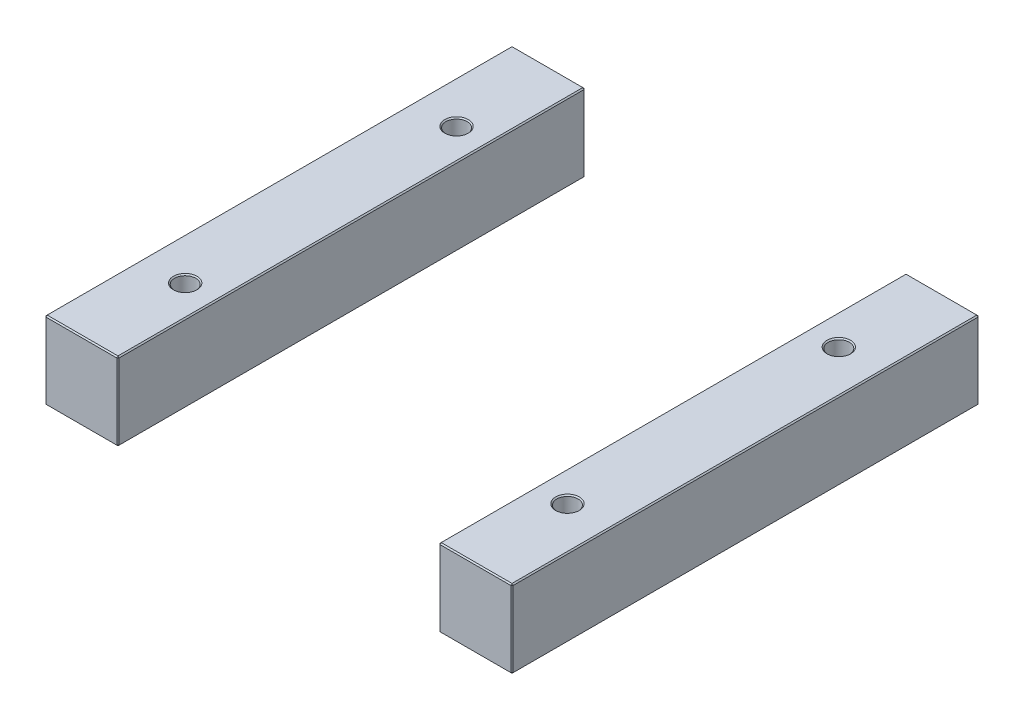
ISO-10303-21;
HEADER;
FILE_DESCRIPTION(('STEP AP214'),'2;1');
FILE_NAME('part.step','',(''),(''),'','','');
FILE_SCHEMA(('AUTOMOTIVE_DESIGN { 1 0 10303 214 1 1 1 1 }'));
ENDSEC;
DATA;
#1=APPLICATION_CONTEXT('core data for automotive mechanical design processes');
#2=APPLICATION_PROTOCOL_DEFINITION('international standard','automotive_design',2000,#1);
#3=PRODUCT_CONTEXT('',#1,'mechanical');
#4=PRODUCT('Part','Part','',(#3));
#5=PRODUCT_RELATED_PRODUCT_CATEGORY('part','',(#4));
#6=PRODUCT_DEFINITION_FORMATION('','',#4);
#7=PRODUCT_DEFINITION_CONTEXT('part definition',#1,'design');
#8=PRODUCT_DEFINITION('design','',#6,#7);
#9=PRODUCT_DEFINITION_SHAPE('','',#8);
#10=(LENGTH_UNIT() NAMED_UNIT(*) SI_UNIT(.MILLI.,.METRE.));
#11=(NAMED_UNIT(*) PLANE_ANGLE_UNIT() SI_UNIT($,.RADIAN.));
#12=(NAMED_UNIT(*) SI_UNIT($,.STERADIAN.) SOLID_ANGLE_UNIT());
#13=UNCERTAINTY_MEASURE_WITH_UNIT(LENGTH_MEASURE(1.E-05),#10,'distance_accuracy_value','');
#14=(GEOMETRIC_REPRESENTATION_CONTEXT(3) GLOBAL_UNCERTAINTY_ASSIGNED_CONTEXT((#13)) GLOBAL_UNIT_ASSIGNED_CONTEXT((#10,
#11,#12)) REPRESENTATION_CONTEXT('',''));
#15=CARTESIAN_POINT('',(0.,0.,0.));
#16=DIRECTION('',(0.,0.,1.));
#17=DIRECTION('',(1.,0.,0.));
#18=AXIS2_PLACEMENT_3D('',#15,#16,#17);
#19=CARTESIAN_POINT('',(-198.,66.,-198.));
#20=DIRECTION('',(0.,0.,1.));
#21=DIRECTION('',(1.,0.,0.));
#22=AXIS2_PLACEMENT_3D('',#19,#20,#21);
#23=PLANE('',#22);
#24=DIRECTION('',(-1.,0.,0.));
#25=VECTOR('',#24,1.);
#26=CARTESIAN_POINT('',(-198.,1.00000000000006,-198.));
#27=LINE('',#26,#25);
#28=CARTESIAN_POINT('',(-137.,1.00000000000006,-198.));
#29=VERTEX_POINT('',#28);
#30=CARTESIAN_POINT('',(-197.,1.00000000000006,-198.));
#31=VERTEX_POINT('',#30);
#32=EDGE_CURVE('P0_E137',#29,#31,#27,.T.);
#33=ORIENTED_EDGE('',*,*,#32,.T.);
#34=DIRECTION('',(0.,1.,0.));
#35=VECTOR('',#34,1.);
#36=CARTESIAN_POINT('',(-197.,66.,-198.));
#37=LINE('',#36,#35);
#38=CARTESIAN_POINT('',(-197.,65.,-198.));
#39=VERTEX_POINT('',#38);
#40=EDGE_CURVE('P0_E235',#31,#39,#37,.T.);
#41=ORIENTED_EDGE('',*,*,#40,.T.);
#42=DIRECTION('',(1.,0.,0.));
#43=VECTOR('',#42,1.);
#44=CARTESIAN_POINT('',(-198.,65.,-198.));
#45=LINE('',#44,#43);
#46=CARTESIAN_POINT('',(-137.,65.,-198.));
#47=VERTEX_POINT('',#46);
#48=EDGE_CURVE('P0_E233',#39,#47,#45,.T.);
#49=ORIENTED_EDGE('',*,*,#48,.T.);
#50=DIRECTION('',(0.,-1.,0.));
#51=VECTOR('',#50,1.);
#52=CARTESIAN_POINT('',(-137.,66.,-198.));
#53=LINE('',#52,#51);
#54=EDGE_CURVE('P0_E230',#47,#29,#53,.T.);
#55=ORIENTED_EDGE('',*,*,#54,.T.);
#56=EDGE_LOOP('',(#33,#41,#49,#55));
#57=FACE_BOUND('',#56,.T.);
#58=ADVANCED_FACE('P0_F16',(#57),#23,.F.);
#59=CARTESIAN_POINT('',(-198.,66.,198.));
#60=DIRECTION('',(1.,0.,0.));
#61=DIRECTION('',(0.,0.,-1.));
#62=AXIS2_PLACEMENT_3D('',#59,#60,#61);
#63=PLANE('',#62);
#64=DIRECTION('',(0.,1.,0.));
#65=VECTOR('',#64,1.);
#66=CARTESIAN_POINT('',(-198.,66.,197.));
#67=LINE('',#66,#65);
#68=CARTESIAN_POINT('',(-198.,1.00000000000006,197.));
#69=VERTEX_POINT('',#68);
#70=CARTESIAN_POINT('',(-198.,65.,197.));
#71=VERTEX_POINT('',#70);
#72=EDGE_CURVE('P0_E217',#69,#71,#67,.T.);
#73=ORIENTED_EDGE('',*,*,#72,.T.);
#74=DIRECTION('',(0.,0.,-1.));
#75=VECTOR('',#74,1.);
#76=CARTESIAN_POINT('',(-198.,65.,198.));
#77=LINE('',#76,#75);
#78=CARTESIAN_POINT('',(-198.,65.,-197.));
#79=VERTEX_POINT('',#78);
#80=EDGE_CURVE('P0_E228',#71,#79,#77,.T.);
#81=ORIENTED_EDGE('',*,*,#80,.T.);
#82=DIRECTION('',(0.,-1.,0.));
#83=VECTOR('',#82,1.);
#84=CARTESIAN_POINT('',(-198.,66.,-197.));
#85=LINE('',#84,#83);
#86=CARTESIAN_POINT('',(-198.,1.00000000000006,-197.));
#87=VERTEX_POINT('',#86);
#88=EDGE_CURVE('P0_E225',#79,#87,#85,.T.);
#89=ORIENTED_EDGE('',*,*,#88,.T.);
#90=DIRECTION('',(0.,0.,1.));
#91=VECTOR('',#90,1.);
#92=CARTESIAN_POINT('',(-198.,1.00000000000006,198.));
#93=LINE('',#92,#91);
#94=EDGE_CURVE('P0_E214',#87,#69,#93,.T.);
#95=ORIENTED_EDGE('',*,*,#94,.T.);
#96=EDGE_LOOP('',(#73,#81,#89,#95));
#97=FACE_BOUND('',#96,.T.);
#98=ADVANCED_FACE('P0_F302',(#97),#63,.F.);
#99=CARTESIAN_POINT('',(-198.,66.,198.));
#100=DIRECTION('',(0.,0.,-1.));
#101=DIRECTION('',(-1.,0.,0.));
#102=AXIS2_PLACEMENT_3D('',#99,#100,#101);
#103=PLANE('',#102);
#104=DIRECTION('',(-1.,0.,0.));
#105=VECTOR('',#104,1.);
#106=CARTESIAN_POINT('',(-198.,65.,198.));
#107=LINE('',#106,#105);
#108=CARTESIAN_POINT('',(-137.,65.,198.));
#109=VERTEX_POINT('',#108);
#110=CARTESIAN_POINT('',(-197.,65.,198.));
#111=VERTEX_POINT('',#110);
#112=EDGE_CURVE('P0_E242',#109,#111,#107,.T.);
#113=ORIENTED_EDGE('',*,*,#112,.T.);
#114=DIRECTION('',(0.,-1.,0.));
#115=VECTOR('',#114,1.);
#116=CARTESIAN_POINT('',(-197.,66.,198.));
#117=LINE('',#116,#115);
#118=CARTESIAN_POINT('',(-197.,1.00000000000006,198.));
#119=VERTEX_POINT('',#118);
#120=EDGE_CURVE('P0_E244',#111,#119,#117,.T.);
#121=ORIENTED_EDGE('',*,*,#120,.T.);
#122=DIRECTION('',(1.,0.,0.));
#123=VECTOR('',#122,1.);
#124=CARTESIAN_POINT('',(-136.,1.00000000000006,198.));
#125=LINE('',#124,#123);
#126=CARTESIAN_POINT('',(-137.,1.00000000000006,198.));
#127=VERTEX_POINT('',#126);
#128=EDGE_CURVE('P0_E240',#119,#127,#125,.T.);
#129=ORIENTED_EDGE('',*,*,#128,.T.);
#130=DIRECTION('',(0.,1.,0.));
#131=VECTOR('',#130,1.);
#132=CARTESIAN_POINT('',(-137.,66.,198.));
#133=LINE('',#132,#131);
#134=EDGE_CURVE('P0_E238',#127,#109,#133,.T.);
#135=ORIENTED_EDGE('',*,*,#134,.T.);
#136=EDGE_LOOP('',(#113,#121,#129,#135));
#137=FACE_BOUND('',#136,.T.);
#138=ADVANCED_FACE('P0_F341',(#137),#103,.F.);
#139=CARTESIAN_POINT('',(-136.,66.,-198.));
#140=DIRECTION('',(-1.,0.,0.));
#141=DIRECTION('',(0.,0.,1.));
#142=AXIS2_PLACEMENT_3D('',#139,#140,#141);
#143=PLANE('',#142);
#144=DIRECTION('',(0.,0.,1.));
#145=VECTOR('',#144,1.);
#146=CARTESIAN_POINT('',(-136.,65.,-198.));
#147=LINE('',#146,#145);
#148=CARTESIAN_POINT('',(-136.,65.,-197.));
#149=VERTEX_POINT('',#148);
#150=CARTESIAN_POINT('',(-136.,65.,197.));
#151=VERTEX_POINT('',#150);
#152=EDGE_CURVE('P0_E31',#149,#151,#147,.T.);
#153=ORIENTED_EDGE('',*,*,#152,.T.);
#154=DIRECTION('',(0.,-1.,0.));
#155=VECTOR('',#154,1.);
#156=CARTESIAN_POINT('',(-136.,66.,197.));
#157=LINE('',#156,#155);
#158=CARTESIAN_POINT('',(-136.,1.00000000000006,197.));
#159=VERTEX_POINT('',#158);
#160=EDGE_CURVE('P0_E190',#151,#159,#157,.T.);
#161=ORIENTED_EDGE('',*,*,#160,.T.);
#162=DIRECTION('',(0.,0.,-1.));
#163=VECTOR('',#162,1.);
#164=CARTESIAN_POINT('',(-136.,1.00000000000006,-198.));
#165=LINE('',#164,#163);
#166=CARTESIAN_POINT('',(-136.,1.00000000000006,-197.));
#167=VERTEX_POINT('',#166);
#168=EDGE_CURVE('P0_E256',#159,#167,#165,.T.);
#169=ORIENTED_EDGE('',*,*,#168,.T.);
#170=DIRECTION('',(0.,1.,0.));
#171=VECTOR('',#170,1.);
#172=CARTESIAN_POINT('',(-136.,66.,-197.));
#173=LINE('',#172,#171);
#174=EDGE_CURVE('P0_E36',#167,#149,#173,.T.);
#175=ORIENTED_EDGE('',*,*,#174,.T.);
#176=EDGE_LOOP('',(#153,#161,#169,#175));
#177=FACE_BOUND('',#176,.T.);
#178=ADVANCED_FACE('P0_F535',(#177),#143,.F.);
#179=CARTESIAN_POINT('',(0.,66.,0.));
#180=DIRECTION('',(0.,-1.,0.));
#181=DIRECTION('',(0.,0.,-1.));
#182=AXIS2_PLACEMENT_3D('',#179,#180,#181);
#183=PLANE('',#182);
#184=CARTESIAN_POINT('',(-162.,66.,115.));
#185=DIRECTION('',(0.,-1.,0.));
#186=DIRECTION('',(0.,0.,-1.));
#187=AXIS2_PLACEMENT_3D('',#184,#185,#186);
#188=CIRCLE('',#187,10.);
#189=CARTESIAN_POINT('',(-162.,66.,105.));
#190=VERTEX_POINT('',#189);
#191=EDGE_CURVE('P0_E24',#190,#190,#188,.T.);
#192=ORIENTED_EDGE('',*,*,#191,.T.);
#193=EDGE_LOOP('',(#192));
#194=FACE_BOUND('',#193,.T.);
#195=CARTESIAN_POINT('',(-162.,66.,-115.));
#196=DIRECTION('',(0.,-1.,0.));
#197=DIRECTION('',(0.,0.,-1.));
#198=AXIS2_PLACEMENT_3D('',#195,#196,#197);
#199=CIRCLE('',#198,10.);
#200=CARTESIAN_POINT('',(-162.,66.,-125.));
#201=VERTEX_POINT('',#200);
#202=EDGE_CURVE('P0_E189',#201,#201,#199,.T.);
#203=ORIENTED_EDGE('',*,*,#202,.T.);
#204=EDGE_LOOP('',(#203));
#205=FACE_BOUND('',#204,.T.);
#206=DIRECTION('',(0.,0.,1.));
#207=VECTOR('',#206,1.);
#208=CARTESIAN_POINT('',(-197.,66.,1.38076979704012E-13));
#209=LINE('',#208,#207);
#210=CARTESIAN_POINT('',(-197.,66.,-197.));
#211=VERTEX_POINT('',#210);
#212=CARTESIAN_POINT('',(-197.,66.,197.));
#213=VERTEX_POINT('',#212);
#214=EDGE_CURVE('P0_E251',#211,#213,#209,.T.);
#215=ORIENTED_EDGE('',*,*,#214,.T.);
#216=DIRECTION('',(1.,0.,0.));
#217=VECTOR('',#216,1.);
#218=CARTESIAN_POINT('',(-1.76382206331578E-13,66.,197.));
#219=LINE('',#218,#217);
#220=CARTESIAN_POINT('',(-137.,66.,197.));
#221=VERTEX_POINT('',#220);
#222=EDGE_CURVE('P0_E253',#213,#221,#219,.T.);
#223=ORIENTED_EDGE('',*,*,#222,.T.);
#224=DIRECTION('',(0.,0.,-1.));
#225=VECTOR('',#224,1.);
#226=CARTESIAN_POINT('',(-137.,66.,0.));
#227=LINE('',#226,#225);
#228=CARTESIAN_POINT('',(-137.,66.,-197.));
#229=VERTEX_POINT('',#228);
#230=EDGE_CURVE('P0_E247',#221,#229,#227,.T.);
#231=ORIENTED_EDGE('',*,*,#230,.T.);
#232=DIRECTION('',(-1.,0.,0.));
#233=VECTOR('',#232,1.);
#234=CARTESIAN_POINT('',(2.64573309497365E-13,66.,-197.));
#235=LINE('',#234,#233);
#236=EDGE_CURVE('P0_E249',#229,#211,#235,.T.);
#237=ORIENTED_EDGE('',*,*,#236,.T.);
#238=EDGE_LOOP('',(#215,#223,#231,#237));
#239=FACE_BOUND('',#238,.T.);
#240=ADVANCED_FACE('P0_F195',(#194,#205,#239),#183,.F.);
#241=CARTESIAN_POINT('',(0.,0.,0.));
#242=DIRECTION('',(0.,-1.,0.));
#243=DIRECTION('',(0.,0.,-1.));
#244=AXIS2_PLACEMENT_3D('',#241,#242,#243);
#245=PLANE('',#244);
#246=CARTESIAN_POINT('',(-162.,0.,-115.));
#247=DIRECTION('',(0.,-1.,0.));
#248=DIRECTION('',(0.,0.,-1.));
#249=AXIS2_PLACEMENT_3D('',#246,#247,#248);
#250=CIRCLE('',#249,10.);
#251=CARTESIAN_POINT('',(-162.,0.,-125.));
#252=VERTEX_POINT('',#251);
#253=EDGE_CURVE('P0_E220',#252,#252,#250,.F.);
#254=ORIENTED_EDGE('',*,*,#253,.T.);
#255=EDGE_LOOP('',(#254));
#256=FACE_BOUND('',#255,.T.);
#257=CARTESIAN_POINT('',(-162.,0.,115.));
#258=DIRECTION('',(0.,-1.,0.));
#259=DIRECTION('',(0.,0.,-1.));
#260=AXIS2_PLACEMENT_3D('',#257,#258,#259);
#261=CIRCLE('',#260,10.);
#262=CARTESIAN_POINT('',(-162.,0.,105.));
#263=VERTEX_POINT('',#262);
#264=EDGE_CURVE('P0_E608',#263,#263,#261,.F.);
#265=ORIENTED_EDGE('',*,*,#264,.T.);
#266=EDGE_LOOP('',(#265));
#267=FACE_BOUND('',#266,.T.);
#268=DIRECTION('',(-1.,0.,0.));
#269=VECTOR('',#268,1.);
#270=CARTESIAN_POINT('',(-198.,0.,197.));
#271=LINE('',#270,#269);
#272=CARTESIAN_POINT('',(-137.,0.,197.));
#273=VERTEX_POINT('',#272);
#274=CARTESIAN_POINT('',(-197.,0.,197.));
#275=VERTEX_POINT('',#274);
#276=EDGE_CURVE('P0_E114',#273,#275,#271,.T.);
#277=ORIENTED_EDGE('',*,*,#276,.T.);
#278=DIRECTION('',(0.,0.,-1.));
#279=VECTOR('',#278,1.);
#280=CARTESIAN_POINT('',(-197.,0.,-198.));
#281=LINE('',#280,#279);
#282=CARTESIAN_POINT('',(-197.,0.,-197.));
#283=VERTEX_POINT('',#282);
#284=EDGE_CURVE('P0_E110',#275,#283,#281,.T.);
#285=ORIENTED_EDGE('',*,*,#284,.T.);
#286=DIRECTION('',(1.,0.,0.));
#287=VECTOR('',#286,1.);
#288=CARTESIAN_POINT('',(-136.,0.,-197.));
#289=LINE('',#288,#287);
#290=CARTESIAN_POINT('',(-137.,0.,-197.));
#291=VERTEX_POINT('',#290);
#292=EDGE_CURVE('P0_E104',#283,#291,#289,.T.);
#293=ORIENTED_EDGE('',*,*,#292,.T.);
#294=DIRECTION('',(0.,0.,1.));
#295=VECTOR('',#294,1.);
#296=CARTESIAN_POINT('',(-137.,0.,198.));
#297=LINE('',#296,#295);
#298=EDGE_CURVE('P0_E107',#291,#273,#297,.T.);
#299=ORIENTED_EDGE('',*,*,#298,.T.);
#300=EDGE_LOOP('',(#277,#285,#293,#299));
#301=FACE_BOUND('',#300,.T.);
#302=ADVANCED_FACE('P0_F106',(#256,#267,#301),#245,.T.);
#303=CARTESIAN_POINT('',(-162.,0.,-115.));
#304=DIRECTION('',(0.,1.,0.));
#305=DIRECTION('',(0.,0.,1.));
#306=AXIS2_PLACEMENT_3D('',#303,#304,#305);
#307=CYLINDRICAL_SURFACE('',#306,9.);
#308=CARTESIAN_POINT('',(-162.,65.,-115.));
#309=DIRECTION('',(0.,-1.,0.));
#310=DIRECTION('',(0.,0.,-1.));
#311=AXIS2_PLACEMENT_3D('',#308,#309,#310);
#312=CIRCLE('',#311,9.);
#313=CARTESIAN_POINT('',(-162.,65.,-124.));
#314=VERTEX_POINT('',#313);
#315=EDGE_CURVE('P0_E10',#314,#314,#312,.F.);
#316=ORIENTED_EDGE('',*,*,#315,.T.);
#317=EDGE_LOOP('',(#316));
#318=FACE_BOUND('',#317,.T.);
#319=CARTESIAN_POINT('',(-162.,0.999999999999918,-115.));
#320=DIRECTION('',(0.,-1.,0.));
#321=DIRECTION('',(0.,0.,-1.));
#322=AXIS2_PLACEMENT_3D('',#319,#320,#321);
#323=CIRCLE('',#322,9.);
#324=CARTESIAN_POINT('',(-162.,0.999999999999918,-124.));
#325=VERTEX_POINT('',#324);
#326=EDGE_CURVE('P0_E215',#325,#325,#323,.T.);
#327=ORIENTED_EDGE('',*,*,#326,.T.);
#328=EDGE_LOOP('',(#327));
#329=FACE_BOUND('',#328,.T.);
#330=ADVANCED_FACE('P0_F208',(#318,#329),#307,.F.);
#331=CARTESIAN_POINT('',(-162.,0.,115.));
#332=DIRECTION('',(0.,1.,0.));
#333=DIRECTION('',(0.,0.,1.));
#334=AXIS2_PLACEMENT_3D('',#331,#332,#333);
#335=CYLINDRICAL_SURFACE('',#334,9.);
#336=CARTESIAN_POINT('',(-162.,65.,115.));
#337=DIRECTION('',(0.,-1.,0.));
#338=DIRECTION('',(0.,0.,-1.));
#339=AXIS2_PLACEMENT_3D('',#336,#337,#338);
#340=CIRCLE('',#339,9.);
#341=CARTESIAN_POINT('',(-162.,65.,106.));
#342=VERTEX_POINT('',#341);
#343=EDGE_CURVE('P0_E186',#342,#342,#340,.F.);
#344=ORIENTED_EDGE('',*,*,#343,.T.);
#345=EDGE_LOOP('',(#344));
#346=FACE_BOUND('',#345,.T.);
#347=CARTESIAN_POINT('',(-162.,0.999999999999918,115.));
#348=DIRECTION('',(0.,-1.,0.));
#349=DIRECTION('',(0.,0.,-1.));
#350=AXIS2_PLACEMENT_3D('',#347,#348,#349);
#351=CIRCLE('',#350,9.);
#352=CARTESIAN_POINT('',(-162.,0.999999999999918,106.));
#353=VERTEX_POINT('',#352);
#354=EDGE_CURVE('P0_E212',#353,#353,#351,.T.);
#355=ORIENTED_EDGE('',*,*,#354,.T.);
#356=EDGE_LOOP('',(#355));
#357=FACE_BOUND('',#356,.T.);
#358=ADVANCED_FACE('P0_F204',(#346,#357),#335,.F.);
#359=CARTESIAN_POINT('',(-162.,0.,-115.));
#360=DIRECTION('',(0.,-1.,0.));
#361=DIRECTION('',(0.,0.,-1.));
#362=AXIS2_PLACEMENT_3D('',#359,#360,#361);
#363=CONICAL_SURFACE('',#362,10.,0.78539816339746);
#364=ORIENTED_EDGE('',*,*,#326,.F.);
#365=EDGE_LOOP('',(#364));
#366=FACE_BOUND('',#365,.T.);
#367=ORIENTED_EDGE('',*,*,#253,.F.);
#368=EDGE_LOOP('',(#367));
#369=FACE_BOUND('',#368,.T.);
#370=ADVANCED_FACE('P0_F207',(#366,#369),#363,.F.);
#371=CARTESIAN_POINT('',(-162.,0.,115.));
#372=DIRECTION('',(0.,-1.,0.));
#373=DIRECTION('',(0.,0.,-1.));
#374=AXIS2_PLACEMENT_3D('',#371,#372,#373);
#375=CONICAL_SURFACE('',#374,10.,0.78539816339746);
#376=ORIENTED_EDGE('',*,*,#354,.F.);
#377=EDGE_LOOP('',(#376));
#378=FACE_BOUND('',#377,.T.);
#379=ORIENTED_EDGE('',*,*,#264,.F.);
#380=EDGE_LOOP('',(#379));
#381=FACE_BOUND('',#380,.T.);
#382=ADVANCED_FACE('P0_F347',(#378,#381),#375,.F.);
#383=CARTESIAN_POINT('',(-136.,66.,197.));
#384=DIRECTION('',(-0.707106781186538,0.,-0.707106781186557));
#385=DIRECTION('',(0.,-1.,0.));
#386=AXIS2_PLACEMENT_3D('',#383,#384,#385);
#387=PLANE('',#386);
#388=DIRECTION('',(-0.707106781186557,0.,0.707106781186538));
#389=VECTOR('',#388,1.);
#390=CARTESIAN_POINT('',(-136.5,65.,197.5));
#391=LINE('',#390,#389);
#392=EDGE_CURVE('P0_E125',#109,#151,#391,.F.);
#393=ORIENTED_EDGE('',*,*,#392,.F.);
#394=ORIENTED_EDGE('',*,*,#134,.F.);
#395=DIRECTION('',(0.707106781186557,0.,-0.707106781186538));
#396=VECTOR('',#395,1.);
#397=CARTESIAN_POINT('',(-137.,1.00000000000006,198.));
#398=LINE('',#397,#396);
#399=EDGE_CURVE('P0_E181',#159,#127,#398,.F.);
#400=ORIENTED_EDGE('',*,*,#399,.F.);
#401=ORIENTED_EDGE('',*,*,#160,.F.);
#402=EDGE_LOOP('',(#393,#394,#400,#401));
#403=FACE_BOUND('',#402,.T.);
#404=ADVANCED_FACE('P0_F351',(#403),#387,.F.);
#405=CARTESIAN_POINT('',(-137.,66.,197.));
#406=DIRECTION('',(0.577350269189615,0.577350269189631,0.577350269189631));
#407=DIRECTION('',(0.,-0.707106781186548,0.707106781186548));
#408=AXIS2_PLACEMENT_3D('',#405,#406,#407);
#409=PLANE('',#408);
#410=DIRECTION('',(0.,0.707106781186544,-0.707106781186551));
#411=VECTOR('',#410,1.);
#412=CARTESIAN_POINT('',(-137.,66.,197.));
#413=LINE('',#412,#411);
#414=EDGE_CURVE('P0_E175',#109,#221,#413,.T.);
#415=ORIENTED_EDGE('',*,*,#414,.F.);
#416=ORIENTED_EDGE('',*,*,#392,.T.);
#417=DIRECTION('',(0.707106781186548,-0.707106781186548,0.));
#418=VECTOR('',#417,1.);
#419=CARTESIAN_POINT('',(-137.,66.,197.));
#420=LINE('',#419,#418);
#421=EDGE_CURVE('P0_E178',#221,#151,#420,.T.);
#422=ORIENTED_EDGE('',*,*,#421,.F.);
#423=EDGE_LOOP('',(#415,#416,#422));
#424=FACE_BOUND('',#423,.T.);
#425=ADVANCED_FACE('P0_F487',(#424),#409,.T.);
#426=CARTESIAN_POINT('',(-137.,1.00000000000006,198.));
#427=DIRECTION('',(0.577350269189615,-0.577350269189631,0.577350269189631));
#428=DIRECTION('',(0.,-0.707106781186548,-0.707106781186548));
#429=AXIS2_PLACEMENT_3D('',#426,#427,#428);
#430=PLANE('',#429);
#431=DIRECTION('',(0.707106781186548,0.707106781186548,0.));
#432=VECTOR('',#431,1.);
#433=CARTESIAN_POINT('',(-136.5,0.500000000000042,197.));
#434=LINE('',#433,#432);
#435=EDGE_CURVE('P0_E123',#159,#273,#434,.F.);
#436=ORIENTED_EDGE('',*,*,#435,.F.);
#437=ORIENTED_EDGE('',*,*,#399,.T.);
#438=DIRECTION('',(0.,-0.707106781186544,-0.707106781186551));
#439=VECTOR('',#438,1.);
#440=CARTESIAN_POINT('',(-137.,1.00000000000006,198.));
#441=LINE('',#440,#439);
#442=EDGE_CURVE('P0_E172',#273,#127,#441,.F.);
#443=ORIENTED_EDGE('',*,*,#442,.F.);
#444=EDGE_LOOP('',(#436,#437,#443));
#445=FACE_BOUND('',#444,.T.);
#446=ADVANCED_FACE('P0_F478',(#445),#430,.T.);
#447=CARTESIAN_POINT('',(-137.,66.,0.));
#448=DIRECTION('',(-0.707106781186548,-0.707106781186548,0.));
#449=DIRECTION('',(0.,0.,-1.));
#450=AXIS2_PLACEMENT_3D('',#447,#448,#449);
#451=PLANE('',#450);
#452=ORIENTED_EDGE('',*,*,#421,.T.);
#453=ORIENTED_EDGE('',*,*,#152,.F.);
#454=DIRECTION('',(-0.707106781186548,0.707106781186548,0.));
#455=VECTOR('',#454,1.);
#456=CARTESIAN_POINT('',(-136.5,65.5,-197.));
#457=LINE('',#456,#455);
#458=EDGE_CURVE('P0_E165',#229,#149,#457,.F.);
#459=ORIENTED_EDGE('',*,*,#458,.F.);
#460=ORIENTED_EDGE('',*,*,#230,.F.);
#461=EDGE_LOOP('',(#452,#453,#459,#460));
#462=FACE_BOUND('',#461,.T.);
#463=ADVANCED_FACE('P0_F318',(#462),#451,.F.);
#464=CARTESIAN_POINT('',(-1.76382206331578E-13,66.,197.));
#465=DIRECTION('',(0.,-0.707106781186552,-0.707106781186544));
#466=DIRECTION('',(1.,0.,0.));
#467=AXIS2_PLACEMENT_3D('',#464,#465,#466);
#468=PLANE('',#467);
#469=ORIENTED_EDGE('',*,*,#414,.T.);
#470=ORIENTED_EDGE('',*,*,#222,.F.);
#471=DIRECTION('',(0.,-0.707106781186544,0.707106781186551));
#472=VECTOR('',#471,1.);
#473=CARTESIAN_POINT('',(-197.,65.5,197.5));
#474=LINE('',#473,#472);
#475=EDGE_CURVE('P0_E162',#111,#213,#474,.F.);
#476=ORIENTED_EDGE('',*,*,#475,.F.);
#477=ORIENTED_EDGE('',*,*,#112,.F.);
#478=EDGE_LOOP('',(#469,#470,#476,#477));
#479=FACE_BOUND('',#478,.T.);
#480=ADVANCED_FACE('P0_F313',(#479),#468,.F.);
#481=CARTESIAN_POINT('',(-197.,66.,198.));
#482=DIRECTION('',(0.707106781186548,0.,-0.707106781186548));
#483=DIRECTION('',(0.,-1.,0.));
#484=AXIS2_PLACEMENT_3D('',#481,#482,#483);
#485=PLANE('',#484);
#486=DIRECTION('',(0.707106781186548,0.,0.707106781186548));
#487=VECTOR('',#486,1.);
#488=CARTESIAN_POINT('',(-197.,1.00000000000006,198.));
#489=LINE('',#488,#487);
#490=EDGE_CURVE('P0_E156',#119,#69,#489,.F.);
#491=ORIENTED_EDGE('',*,*,#490,.F.);
#492=ORIENTED_EDGE('',*,*,#120,.F.);
#493=DIRECTION('',(-0.707106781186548,0.,-0.707106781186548));
#494=VECTOR('',#493,1.);
#495=CARTESIAN_POINT('',(-198.,65.,197.));
#496=LINE('',#495,#494);
#497=EDGE_CURVE('P0_E159',#71,#111,#496,.F.);
#498=ORIENTED_EDGE('',*,*,#497,.F.);
#499=ORIENTED_EDGE('',*,*,#72,.F.);
#500=EDGE_LOOP('',(#491,#492,#498,#499));
#501=FACE_BOUND('',#500,.T.);
#502=ADVANCED_FACE('P0_F307',(#501),#485,.F.);
#503=CARTESIAN_POINT('',(-198.,1.00000000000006,198.));
#504=DIRECTION('',(0.,-0.707106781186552,0.707106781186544));
#505=DIRECTION('',(-1.,0.,0.));
#506=AXIS2_PLACEMENT_3D('',#503,#504,#505);
#507=PLANE('',#506);
#508=ORIENTED_EDGE('',*,*,#442,.T.);
#509=ORIENTED_EDGE('',*,*,#128,.F.);
#510=DIRECTION('',(0.,0.707106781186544,0.707106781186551));
#511=VECTOR('',#510,1.);
#512=CARTESIAN_POINT('',(-197.,1.00000000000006,198.));
#513=LINE('',#512,#511);
#514=EDGE_CURVE('P0_E134',#275,#119,#513,.T.);
#515=ORIENTED_EDGE('',*,*,#514,.F.);
#516=ORIENTED_EDGE('',*,*,#276,.F.);
#517=EDGE_LOOP('',(#508,#509,#515,#516));
#518=FACE_BOUND('',#517,.T.);
#519=ADVANCED_FACE('P0_F333',(#518),#507,.T.);
#520=CARTESIAN_POINT('',(-136.,1.00000000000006,-198.));
#521=DIRECTION('',(0.707106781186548,-0.707106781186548,0.));
#522=DIRECTION('',(0.,0.,1.));
#523=AXIS2_PLACEMENT_3D('',#520,#521,#522);
#524=PLANE('',#523);
#525=ORIENTED_EDGE('',*,*,#435,.T.);
#526=ORIENTED_EDGE('',*,*,#298,.F.);
#527=DIRECTION('',(-0.707106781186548,-0.707106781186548,0.));
#528=VECTOR('',#527,1.);
#529=CARTESIAN_POINT('',(-137.,0.,-197.));
#530=LINE('',#529,#528);
#531=EDGE_CURVE('P0_E120',#167,#291,#530,.T.);
#532=ORIENTED_EDGE('',*,*,#531,.F.);
#533=ORIENTED_EDGE('',*,*,#168,.F.);
#534=EDGE_LOOP('',(#525,#526,#532,#533));
#535=FACE_BOUND('',#534,.T.);
#536=ADVANCED_FACE('P0_F119',(#535),#524,.T.);
#537=CARTESIAN_POINT('',(-137.,66.,-198.));
#538=DIRECTION('',(-0.707106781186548,0.,0.707106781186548));
#539=DIRECTION('',(0.,-1.,0.));
#540=AXIS2_PLACEMENT_3D('',#537,#538,#539);
#541=PLANE('',#540);
#542=DIRECTION('',(0.707106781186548,0.,0.707106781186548));
#543=VECTOR('',#542,1.);
#544=CARTESIAN_POINT('',(-137.,65.,-198.));
#545=LINE('',#544,#543);
#546=EDGE_CURVE('P0_E168',#149,#47,#545,.F.);
#547=ORIENTED_EDGE('',*,*,#546,.F.);
#548=ORIENTED_EDGE('',*,*,#174,.F.);
#549=DIRECTION('',(-0.707106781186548,0.,-0.707106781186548));
#550=VECTOR('',#549,1.);
#551=CARTESIAN_POINT('',(-136.5,1.00000000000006,-197.5));
#552=LINE('',#551,#550);
#553=EDGE_CURVE('P0_E133',#29,#167,#552,.F.);
#554=ORIENTED_EDGE('',*,*,#553,.F.);
#555=ORIENTED_EDGE('',*,*,#54,.F.);
#556=EDGE_LOOP('',(#547,#548,#554,#555));
#557=FACE_BOUND('',#556,.T.);
#558=ADVANCED_FACE('P0_F323',(#557),#541,.F.);
#559=CARTESIAN_POINT('',(-137.,65.,-198.));
#560=DIRECTION('',(0.577350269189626,0.577350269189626,-0.577350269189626));
#561=DIRECTION('',(-0.707106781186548,0.,-0.707106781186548));
#562=AXIS2_PLACEMENT_3D('',#559,#560,#561);
#563=PLANE('',#562);
#564=ORIENTED_EDGE('',*,*,#458,.T.);
#565=ORIENTED_EDGE('',*,*,#546,.T.);
#566=DIRECTION('',(0.,-0.707106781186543,-0.707106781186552));
#567=VECTOR('',#566,1.);
#568=CARTESIAN_POINT('',(-137.,65.,-198.));
#569=LINE('',#568,#567);
#570=EDGE_CURVE('P0_E151',#229,#47,#569,.T.);
#571=ORIENTED_EDGE('',*,*,#570,.F.);
#572=EDGE_LOOP('',(#564,#565,#571));
#573=FACE_BOUND('',#572,.T.);
#574=ADVANCED_FACE('P0_F321',(#573),#563,.T.);
#575=CARTESIAN_POINT('',(-198.,65.,197.));
#576=DIRECTION('',(-0.577350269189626,0.577350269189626,0.577350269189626));
#577=DIRECTION('',(0.707106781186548,0.,0.707106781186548));
#578=AXIS2_PLACEMENT_3D('',#575,#576,#577);
#579=PLANE('',#578);
#580=ORIENTED_EDGE('',*,*,#497,.T.);
#581=ORIENTED_EDGE('',*,*,#475,.T.);
#582=DIRECTION('',(0.707106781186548,0.707106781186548,0.));
#583=VECTOR('',#582,1.);
#584=CARTESIAN_POINT('',(-198.,65.,197.));
#585=LINE('',#584,#583);
#586=EDGE_CURVE('P0_E142',#71,#213,#585,.T.);
#587=ORIENTED_EDGE('',*,*,#586,.F.);
#588=EDGE_LOOP('',(#580,#581,#587));
#589=FACE_BOUND('',#588,.T.);
#590=ADVANCED_FACE('P0_F310',(#589),#579,.T.);
#591=CARTESIAN_POINT('',(-197.,1.00000000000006,198.));
#592=DIRECTION('',(-0.577350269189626,-0.577350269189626,0.577350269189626));
#593=DIRECTION('',(0.707106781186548,0.,0.707106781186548));
#594=AXIS2_PLACEMENT_3D('',#591,#592,#593);
#595=PLANE('',#594);
#596=ORIENTED_EDGE('',*,*,#514,.T.);
#597=ORIENTED_EDGE('',*,*,#490,.T.);
#598=DIRECTION('',(0.707106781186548,-0.707106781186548,0.));
#599=VECTOR('',#598,1.);
#600=CARTESIAN_POINT('',(-197.5,0.500000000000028,197.));
#601=LINE('',#600,#599);
#602=EDGE_CURVE('P0_E138',#275,#69,#601,.F.);
#603=ORIENTED_EDGE('',*,*,#602,.F.);
#604=EDGE_LOOP('',(#596,#597,#603));
#605=FACE_BOUND('',#604,.T.);
#606=ADVANCED_FACE('P0_F368',(#605),#595,.T.);
#607=CARTESIAN_POINT('',(-137.,0.,-197.));
#608=DIRECTION('',(0.577350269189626,-0.577350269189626,-0.577350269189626));
#609=DIRECTION('',(-0.707106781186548,0.,-0.707106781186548));
#610=AXIS2_PLACEMENT_3D('',#607,#608,#609);
#611=PLANE('',#610);
#612=ORIENTED_EDGE('',*,*,#553,.T.);
#613=ORIENTED_EDGE('',*,*,#531,.T.);
#614=DIRECTION('',(0.,0.707106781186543,-0.707106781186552));
#615=VECTOR('',#614,1.);
#616=CARTESIAN_POINT('',(-137.,0.,-197.));
#617=LINE('',#616,#615);
#618=EDGE_CURVE('P0_E130',#29,#291,#617,.F.);
#619=ORIENTED_EDGE('',*,*,#618,.F.);
#620=EDGE_LOOP('',(#612,#613,#619));
#621=FACE_BOUND('',#620,.T.);
#622=ADVANCED_FACE('P0_F129',(#621),#611,.T.);
#623=CARTESIAN_POINT('',(2.64573309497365E-13,66.,-197.));
#624=DIRECTION('',(0.,-0.707106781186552,0.707106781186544));
#625=DIRECTION('',(-1.,0.,0.));
#626=AXIS2_PLACEMENT_3D('',#623,#624,#625);
#627=PLANE('',#626);
#628=ORIENTED_EDGE('',*,*,#570,.T.);
#629=ORIENTED_EDGE('',*,*,#48,.F.);
#630=DIRECTION('',(0.,0.707106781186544,0.707106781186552));
#631=VECTOR('',#630,1.);
#632=CARTESIAN_POINT('',(-197.,65.,-198.));
#633=LINE('',#632,#631);
#634=EDGE_CURVE('P0_E139',#211,#39,#633,.F.);
#635=ORIENTED_EDGE('',*,*,#634,.F.);
#636=ORIENTED_EDGE('',*,*,#236,.F.);
#637=EDGE_LOOP('',(#628,#629,#635,#636));
#638=FACE_BOUND('',#637,.T.);
#639=ADVANCED_FACE('P0_F286',(#638),#627,.F.);
#640=CARTESIAN_POINT('',(-197.,66.,1.38076979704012E-13));
#641=DIRECTION('',(0.707106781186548,-0.707106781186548,0.));
#642=DIRECTION('',(0.,0.,1.));
#643=AXIS2_PLACEMENT_3D('',#640,#641,#642);
#644=PLANE('',#643);
#645=ORIENTED_EDGE('',*,*,#586,.T.);
#646=ORIENTED_EDGE('',*,*,#214,.F.);
#647=DIRECTION('',(-0.707106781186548,-0.707106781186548,0.));
#648=VECTOR('',#647,1.);
#649=CARTESIAN_POINT('',(-197.5,65.5,-197.));
#650=LINE('',#649,#648);
#651=EDGE_CURVE('P0_E145',#79,#211,#650,.F.);
#652=ORIENTED_EDGE('',*,*,#651,.F.);
#653=ORIENTED_EDGE('',*,*,#80,.F.);
#654=EDGE_LOOP('',(#645,#646,#652,#653));
#655=FACE_BOUND('',#654,.T.);
#656=ADVANCED_FACE('P0_F280',(#655),#644,.F.);
#657=CARTESIAN_POINT('',(-198.,1.00000000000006,198.));
#658=DIRECTION('',(-0.707106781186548,-0.707106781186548,0.));
#659=DIRECTION('',(0.,0.,-1.));
#660=AXIS2_PLACEMENT_3D('',#657,#658,#659);
#661=PLANE('',#660);
#662=ORIENTED_EDGE('',*,*,#602,.T.);
#663=ORIENTED_EDGE('',*,*,#94,.F.);
#664=DIRECTION('',(-0.707106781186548,0.707106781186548,0.));
#665=VECTOR('',#664,1.);
#666=CARTESIAN_POINT('',(-198.,1.00000000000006,-197.));
#667=LINE('',#666,#665);
#668=EDGE_CURVE('P0_E267',#283,#87,#667,.T.);
#669=ORIENTED_EDGE('',*,*,#668,.F.);
#670=ORIENTED_EDGE('',*,*,#284,.F.);
#671=EDGE_LOOP('',(#662,#663,#669,#670));
#672=FACE_BOUND('',#671,.T.);
#673=ADVANCED_FACE('P0_F298',(#672),#661,.T.);
#674=CARTESIAN_POINT('',(-198.,1.00000000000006,-198.));
#675=DIRECTION('',(0.,-0.707106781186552,-0.707106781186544));
#676=DIRECTION('',(1.,0.,0.));
#677=AXIS2_PLACEMENT_3D('',#674,#675,#676);
#678=PLANE('',#677);
#679=ORIENTED_EDGE('',*,*,#618,.T.);
#680=ORIENTED_EDGE('',*,*,#292,.F.);
#681=DIRECTION('',(0.,-0.707106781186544,0.707106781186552));
#682=VECTOR('',#681,1.);
#683=CARTESIAN_POINT('',(-197.,0.500000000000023,-197.5));
#684=LINE('',#683,#682);
#685=EDGE_CURVE('P0_E265',#31,#283,#684,.T.);
#686=ORIENTED_EDGE('',*,*,#685,.F.);
#687=ORIENTED_EDGE('',*,*,#32,.F.);
#688=EDGE_LOOP('',(#679,#680,#686,#687));
#689=FACE_BOUND('',#688,.T.);
#690=ADVANCED_FACE('P0_F136',(#689),#678,.T.);
#691=CARTESIAN_POINT('',(-197.,65.,-198.));
#692=DIRECTION('',(-0.577350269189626,0.577350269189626,-0.577350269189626));
#693=DIRECTION('',(-0.707106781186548,0.,0.707106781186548));
#694=AXIS2_PLACEMENT_3D('',#691,#692,#693);
#695=PLANE('',#694);
#696=ORIENTED_EDGE('',*,*,#651,.T.);
#697=ORIENTED_EDGE('',*,*,#634,.T.);
#698=DIRECTION('',(0.707106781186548,0.,-0.707106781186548));
#699=VECTOR('',#698,1.);
#700=CARTESIAN_POINT('',(-197.,65.,-198.));
#701=LINE('',#700,#699);
#702=EDGE_CURVE('P0_E263',#79,#39,#701,.T.);
#703=ORIENTED_EDGE('',*,*,#702,.F.);
#704=EDGE_LOOP('',(#696,#697,#703));
#705=FACE_BOUND('',#704,.T.);
#706=ADVANCED_FACE('P0_F273',(#705),#695,.T.);
#707=CARTESIAN_POINT('',(-198.,1.00000000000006,-197.));
#708=DIRECTION('',(-0.577350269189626,-0.577350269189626,-0.577350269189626));
#709=DIRECTION('',(-0.707106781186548,0.,0.707106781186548));
#710=AXIS2_PLACEMENT_3D('',#707,#708,#709);
#711=PLANE('',#710);
#712=ORIENTED_EDGE('',*,*,#685,.T.);
#713=ORIENTED_EDGE('',*,*,#668,.T.);
#714=DIRECTION('',(-0.707106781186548,0.,0.707106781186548));
#715=VECTOR('',#714,1.);
#716=CARTESIAN_POINT('',(-198.,1.00000000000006,-197.));
#717=LINE('',#716,#715);
#718=EDGE_CURVE('P0_E261',#31,#87,#717,.T.);
#719=ORIENTED_EDGE('',*,*,#718,.F.);
#720=EDGE_LOOP('',(#712,#713,#719));
#721=FACE_BOUND('',#720,.T.);
#722=ADVANCED_FACE('P0_F294',(#721),#711,.T.);
#723=CARTESIAN_POINT('',(-198.,66.,-197.));
#724=DIRECTION('',(0.707106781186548,0.,0.707106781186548));
#725=DIRECTION('',(0.,-1.,0.));
#726=AXIS2_PLACEMENT_3D('',#723,#724,#725);
#727=PLANE('',#726);
#728=ORIENTED_EDGE('',*,*,#702,.T.);
#729=ORIENTED_EDGE('',*,*,#40,.F.);
#730=ORIENTED_EDGE('',*,*,#718,.T.);
#731=ORIENTED_EDGE('',*,*,#88,.F.);
#732=EDGE_LOOP('',(#728,#729,#730,#731));
#733=FACE_BOUND('',#732,.T.);
#734=ADVANCED_FACE('P0_F201',(#733),#727,.F.);
#735=CARTESIAN_POINT('',(-162.,65.,115.));
#736=DIRECTION('',(0.,1.,0.));
#737=DIRECTION('',(0.,0.,1.));
#738=AXIS2_PLACEMENT_3D('',#735,#736,#737);
#739=CONICAL_SURFACE('',#738,9.,0.78539816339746);
#740=ORIENTED_EDGE('',*,*,#191,.F.);
#741=EDGE_LOOP('',(#740));
#742=FACE_BOUND('',#741,.T.);
#743=ORIENTED_EDGE('',*,*,#343,.F.);
#744=EDGE_LOOP('',(#743));
#745=FACE_BOUND('',#744,.T.);
#746=ADVANCED_FACE('P0_F198',(#742,#745),#739,.F.);
#747=CARTESIAN_POINT('',(-162.,65.,-115.));
#748=DIRECTION('',(0.,1.,0.));
#749=DIRECTION('',(0.,0.,1.));
#750=AXIS2_PLACEMENT_3D('',#747,#748,#749);
#751=CONICAL_SURFACE('',#750,9.,0.785398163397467);
#752=ORIENTED_EDGE('',*,*,#202,.F.);
#753=EDGE_LOOP('',(#752));
#754=FACE_BOUND('',#753,.T.);
#755=ORIENTED_EDGE('',*,*,#315,.F.);
#756=EDGE_LOOP('',(#755));
#757=FACE_BOUND('',#756,.T.);
#758=ADVANCED_FACE('P0_F18',(#754,#757),#751,.F.);
#759=CLOSED_SHELL('',(#58,#98,#138,#178,#240,#302,#330,#358,#370,#382,#404,#425,#446,#463,#480,
#502,#519,#536,#558,#574,#590,#606,#622,#639,#656,#673,#690,#706,#722,#734,#746,#758));
#760=MANIFOLD_SOLID_BREP('P0_B1',#759);
#761=CARTESIAN_POINT('',(198.,66.,198.));
#762=DIRECTION('',(0.,0.,-1.));
#763=DIRECTION('',(-1.,0.,0.));
#764=AXIS2_PLACEMENT_3D('',#761,#762,#763);
#765=PLANE('',#764);
#766=DIRECTION('',(0.,-1.,0.));
#767=VECTOR('',#766,1.);
#768=CARTESIAN_POINT('',(137.,66.,198.));
#769=LINE('',#768,#767);
#770=CARTESIAN_POINT('',(137.,65.,198.));
#771=VERTEX_POINT('',#770);
#772=CARTESIAN_POINT('',(137.,1.00000000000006,198.));
#773=VERTEX_POINT('',#772);
#774=EDGE_CURVE('P1_E174',#771,#773,#769,.T.);
#775=ORIENTED_EDGE('',*,*,#774,.T.);
#776=DIRECTION('',(1.,0.,0.));
#777=VECTOR('',#776,1.);
#778=CARTESIAN_POINT('',(198.,1.00000000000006,198.));
#779=LINE('',#778,#777);
#780=CARTESIAN_POINT('',(197.,1.00000000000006,198.));
#781=VERTEX_POINT('',#780);
#782=EDGE_CURVE('P1_E176',#773,#781,#779,.T.);
#783=ORIENTED_EDGE('',*,*,#782,.T.);
#784=DIRECTION('',(0.,1.,0.));
#785=VECTOR('',#784,1.);
#786=CARTESIAN_POINT('',(197.,66.,198.));
#787=LINE('',#786,#785);
#788=CARTESIAN_POINT('',(197.,65.,198.));
#789=VERTEX_POINT('',#788);
#790=EDGE_CURVE('P1_E172',#781,#789,#787,.T.);
#791=ORIENTED_EDGE('',*,*,#790,.T.);
#792=DIRECTION('',(-1.,0.,0.));
#793=VECTOR('',#792,1.);
#794=CARTESIAN_POINT('',(136.,65.,198.));
#795=LINE('',#794,#793);
#796=EDGE_CURVE('P1_E170',#789,#771,#795,.T.);
#797=ORIENTED_EDGE('',*,*,#796,.T.);
#798=EDGE_LOOP('',(#775,#783,#791,#797));
#799=FACE_BOUND('',#798,.T.);
#800=ADVANCED_FACE('P1_F17',(#799),#765,.F.);
#801=CARTESIAN_POINT('',(198.,66.,198.));
#802=DIRECTION('',(-1.,0.,0.));
#803=DIRECTION('',(0.,0.,1.));
#804=AXIS2_PLACEMENT_3D('',#801,#802,#803);
#805=PLANE('',#804);
#806=DIRECTION('',(0.,0.,1.));
#807=VECTOR('',#806,1.);
#808=CARTESIAN_POINT('',(198.,65.,198.));
#809=LINE('',#808,#807);
#810=CARTESIAN_POINT('',(198.,65.,-197.));
#811=VERTEX_POINT('',#810);
#812=CARTESIAN_POINT('',(198.,65.,197.));
#813=VERTEX_POINT('',#812);
#814=EDGE_CURVE('P1_E188',#811,#813,#809,.T.);
#815=ORIENTED_EDGE('',*,*,#814,.T.);
#816=DIRECTION('',(0.,-1.,0.));
#817=VECTOR('',#816,1.);
#818=CARTESIAN_POINT('',(198.,66.,197.));
#819=LINE('',#818,#817);
#820=CARTESIAN_POINT('',(198.,1.00000000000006,197.));
#821=VERTEX_POINT('',#820);
#822=EDGE_CURVE('P1_E194',#813,#821,#819,.T.);
#823=ORIENTED_EDGE('',*,*,#822,.T.);
#824=DIRECTION('',(0.,0.,-1.));
#825=VECTOR('',#824,1.);
#826=CARTESIAN_POINT('',(198.,1.00000000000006,198.));
#827=LINE('',#826,#825);
#828=CARTESIAN_POINT('',(198.,1.00000000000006,-197.));
#829=VERTEX_POINT('',#828);
#830=EDGE_CURVE('P1_E192',#821,#829,#827,.T.);
#831=ORIENTED_EDGE('',*,*,#830,.T.);
#832=DIRECTION('',(0.,1.,0.));
#833=VECTOR('',#832,1.);
#834=CARTESIAN_POINT('',(198.,66.,-197.));
#835=LINE('',#834,#833);
#836=EDGE_CURVE('P1_E190',#829,#811,#835,.T.);
#837=ORIENTED_EDGE('',*,*,#836,.T.);
#838=EDGE_LOOP('',(#815,#823,#831,#837));
#839=FACE_BOUND('',#838,.T.);
#840=ADVANCED_FACE('P1_F276',(#839),#805,.F.);
#841=CARTESIAN_POINT('',(198.,66.,-198.));
#842=DIRECTION('',(0.,0.,1.));
#843=DIRECTION('',(1.,0.,0.));
#844=AXIS2_PLACEMENT_3D('',#841,#842,#843);
#845=PLANE('',#844);
#846=DIRECTION('',(0.,-1.,0.));
#847=VECTOR('',#846,1.);
#848=CARTESIAN_POINT('',(197.,66.,-198.));
#849=LINE('',#848,#847);
#850=CARTESIAN_POINT('',(197.,65.,-198.));
#851=VERTEX_POINT('',#850);
#852=CARTESIAN_POINT('',(197.,1.00000000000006,-198.));
#853=VERTEX_POINT('',#852);
#854=EDGE_CURVE('P1_E165',#851,#853,#849,.T.);
#855=ORIENTED_EDGE('',*,*,#854,.T.);
#856=DIRECTION('',(-1.,0.,0.));
#857=VECTOR('',#856,1.);
#858=CARTESIAN_POINT('',(198.,1.00000000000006,-198.));
#859=LINE('',#858,#857);
#860=CARTESIAN_POINT('',(137.,1.00000000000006,-198.));
#861=VERTEX_POINT('',#860);
#862=EDGE_CURVE('P1_E113',#853,#861,#859,.T.);
#863=ORIENTED_EDGE('',*,*,#862,.T.);
#864=DIRECTION('',(0.,1.,0.));
#865=VECTOR('',#864,1.);
#866=CARTESIAN_POINT('',(137.,66.,-198.));
#867=LINE('',#866,#865);
#868=CARTESIAN_POINT('',(137.,65.,-198.));
#869=VERTEX_POINT('',#868);
#870=EDGE_CURVE('P1_E167',#861,#869,#867,.T.);
#871=ORIENTED_EDGE('',*,*,#870,.T.);
#872=DIRECTION('',(1.,0.,0.));
#873=VECTOR('',#872,1.);
#874=CARTESIAN_POINT('',(198.,65.,-198.));
#875=LINE('',#874,#873);
#876=EDGE_CURVE('P1_E163',#869,#851,#875,.T.);
#877=ORIENTED_EDGE('',*,*,#876,.T.);
#878=EDGE_LOOP('',(#855,#863,#871,#877));
#879=FACE_BOUND('',#878,.T.);
#880=ADVANCED_FACE('P1_F333',(#879),#845,.F.);
#881=CARTESIAN_POINT('',(136.,66.,-198.));
#882=DIRECTION('',(1.,0.,0.));
#883=DIRECTION('',(0.,0.,-1.));
#884=AXIS2_PLACEMENT_3D('',#881,#882,#883);
#885=PLANE('',#884);
#886=DIRECTION('',(0.,0.,-1.));
#887=VECTOR('',#886,1.);
#888=CARTESIAN_POINT('',(136.,65.,-198.));
#889=LINE('',#888,#887);
#890=CARTESIAN_POINT('',(136.,65.,197.));
#891=VERTEX_POINT('',#890);
#892=CARTESIAN_POINT('',(136.,65.,-197.));
#893=VERTEX_POINT('',#892);
#894=EDGE_CURVE('P1_E179',#891,#893,#889,.T.);
#895=ORIENTED_EDGE('',*,*,#894,.T.);
#896=DIRECTION('',(0.,-1.,0.));
#897=VECTOR('',#896,1.);
#898=CARTESIAN_POINT('',(136.,66.,-197.));
#899=LINE('',#898,#897);
#900=CARTESIAN_POINT('',(136.,1.00000000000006,-197.));
#901=VERTEX_POINT('',#900);
#902=EDGE_CURVE('P1_E185',#893,#901,#899,.T.);
#903=ORIENTED_EDGE('',*,*,#902,.T.);
#904=DIRECTION('',(0.,0.,1.));
#905=VECTOR('',#904,1.);
#906=CARTESIAN_POINT('',(136.,1.00000000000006,-198.));
#907=LINE('',#906,#905);
#908=CARTESIAN_POINT('',(136.,1.00000000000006,197.));
#909=VERTEX_POINT('',#908);
#910=EDGE_CURVE('P1_E183',#901,#909,#907,.T.);
#911=ORIENTED_EDGE('',*,*,#910,.T.);
#912=DIRECTION('',(0.,1.,0.));
#913=VECTOR('',#912,1.);
#914=CARTESIAN_POINT('',(136.,66.,197.));
#915=LINE('',#914,#913);
#916=EDGE_CURVE('P1_E181',#909,#891,#915,.T.);
#917=ORIENTED_EDGE('',*,*,#916,.T.);
#918=EDGE_LOOP('',(#895,#903,#911,#917));
#919=FACE_BOUND('',#918,.T.);
#920=ADVANCED_FACE('P1_F544',(#919),#885,.F.);
#921=CARTESIAN_POINT('',(0.,66.,0.));
#922=DIRECTION('',(0.,1.,0.));
#923=DIRECTION('',(0.,0.,1.));
#924=AXIS2_PLACEMENT_3D('',#921,#922,#923);
#925=PLANE('',#924);
#926=DIRECTION('',(-1.,0.,0.));
#927=VECTOR('',#926,1.);
#928=CARTESIAN_POINT('',(136.,66.,-197.));
#929=LINE('',#928,#927);
#930=CARTESIAN_POINT('',(197.,66.,-197.));
#931=VERTEX_POINT('',#930);
#932=CARTESIAN_POINT('',(137.,66.,-197.));
#933=VERTEX_POINT('',#932);
#934=EDGE_CURVE('P1_E26',#931,#933,#929,.T.);
#935=ORIENTED_EDGE('',*,*,#934,.T.);
#936=DIRECTION('',(0.,0.,1.));
#937=VECTOR('',#936,1.);
#938=CARTESIAN_POINT('',(137.,66.,198.));
#939=LINE('',#938,#937);
#940=CARTESIAN_POINT('',(137.,66.,197.));
#941=VERTEX_POINT('',#940);
#942=EDGE_CURVE('P1_E11',#933,#941,#939,.T.);
#943=ORIENTED_EDGE('',*,*,#942,.T.);
#944=DIRECTION('',(1.,0.,0.));
#945=VECTOR('',#944,1.);
#946=CARTESIAN_POINT('',(198.,66.,197.));
#947=LINE('',#946,#945);
#948=CARTESIAN_POINT('',(197.,66.,197.));
#949=VERTEX_POINT('',#948);
#950=EDGE_CURVE('P1_E203',#941,#949,#947,.T.);
#951=ORIENTED_EDGE('',*,*,#950,.T.);
#952=DIRECTION('',(0.,0.,-1.));
#953=VECTOR('',#952,1.);
#954=CARTESIAN_POINT('',(197.,66.,-198.));
#955=LINE('',#954,#953);
#956=EDGE_CURVE('P1_E37',#949,#931,#955,.T.);
#957=ORIENTED_EDGE('',*,*,#956,.T.);
#958=EDGE_LOOP('',(#935,#943,#951,#957));
#959=FACE_BOUND('',#958,.T.);
#960=CARTESIAN_POINT('',(162.,66.,-115.));
#961=DIRECTION('',(0.,1.,0.));
#962=DIRECTION('',(0.,0.,1.));
#963=AXIS2_PLACEMENT_3D('',#960,#961,#962);
#964=CIRCLE('',#963,10.);
#965=CARTESIAN_POINT('',(162.,66.,-105.));
#966=VERTEX_POINT('',#965);
#967=EDGE_CURVE('P1_E200',#966,#966,#964,.F.);
#968=ORIENTED_EDGE('',*,*,#967,.T.);
#969=EDGE_LOOP('',(#968));
#970=FACE_BOUND('',#969,.T.);
#971=CARTESIAN_POINT('',(162.,66.,115.));
#972=DIRECTION('',(0.,1.,0.));
#973=DIRECTION('',(0.,0.,1.));
#974=AXIS2_PLACEMENT_3D('',#971,#972,#973);
#975=CIRCLE('',#974,10.);
#976=CARTESIAN_POINT('',(162.,66.,125.));
#977=VERTEX_POINT('',#976);
#978=EDGE_CURVE('P1_E197',#977,#977,#975,.F.);
#979=ORIENTED_EDGE('',*,*,#978,.T.);
#980=EDGE_LOOP('',(#979));
#981=FACE_BOUND('',#980,.T.);
#982=ADVANCED_FACE('P1_F299',(#959,#970,#981),#925,.T.);
#983=CARTESIAN_POINT('',(0.,0.,0.));
#984=DIRECTION('',(0.,1.,0.));
#985=DIRECTION('',(0.,0.,1.));
#986=AXIS2_PLACEMENT_3D('',#983,#984,#985);
#987=PLANE('',#986);
#988=CARTESIAN_POINT('',(162.,0.,-115.));
#989=DIRECTION('',(0.,1.,0.));
#990=DIRECTION('',(0.,0.,1.));
#991=AXIS2_PLACEMENT_3D('',#988,#989,#990);
#992=CIRCLE('',#991,10.);
#993=CARTESIAN_POINT('',(162.,0.,-105.));
#994=VERTEX_POINT('',#993);
#995=EDGE_CURVE('P1_E148',#994,#994,#992,.T.);
#996=ORIENTED_EDGE('',*,*,#995,.T.);
#997=EDGE_LOOP('',(#996));
#998=FACE_BOUND('',#997,.T.);
#999=CARTESIAN_POINT('',(162.,0.,115.));
#1000=DIRECTION('',(0.,1.,0.));
#1001=DIRECTION('',(0.,0.,1.));
#1002=AXIS2_PLACEMENT_3D('',#999,#1000,#1001);
#1003=CIRCLE('',#1002,10.);
#1004=CARTESIAN_POINT('',(162.,0.,125.));
#1005=VERTEX_POINT('',#1004);
#1006=EDGE_CURVE('P1_E142',#1005,#1005,#1003,.T.);
#1007=ORIENTED_EDGE('',*,*,#1006,.T.);
#1008=EDGE_LOOP('',(#1007));
#1009=FACE_BOUND('',#1008,.T.);
#1010=DIRECTION('',(-1.,0.,0.));
#1011=VECTOR('',#1010,1.);
#1012=CARTESIAN_POINT('',(2.64573309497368E-13,0.,197.));
#1013=LINE('',#1012,#1011);
#1014=CARTESIAN_POINT('',(197.,0.,197.));
#1015=VERTEX_POINT('',#1014);
#1016=CARTESIAN_POINT('',(137.,0.,197.));
#1017=VERTEX_POINT('',#1016);
#1018=EDGE_CURVE('P1_E135',#1015,#1017,#1013,.T.);
#1019=ORIENTED_EDGE('',*,*,#1018,.T.);
#1020=DIRECTION('',(0.,0.,-1.));
#1021=VECTOR('',#1020,1.);
#1022=CARTESIAN_POINT('',(137.,0.,0.));
#1023=LINE('',#1022,#1021);
#1024=CARTESIAN_POINT('',(137.,0.,-197.));
#1025=VERTEX_POINT('',#1024);
#1026=EDGE_CURVE('P1_E139',#1017,#1025,#1023,.T.);
#1027=ORIENTED_EDGE('',*,*,#1026,.T.);
#1028=DIRECTION('',(1.,0.,0.));
#1029=VECTOR('',#1028,1.);
#1030=CARTESIAN_POINT('',(-1.23467544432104E-12,0.,-197.));
#1031=LINE('',#1030,#1029);
#1032=CARTESIAN_POINT('',(197.,0.,-197.));
#1033=VERTEX_POINT('',#1032);
#1034=EDGE_CURVE('P1_E110',#1025,#1033,#1031,.T.);
#1035=ORIENTED_EDGE('',*,*,#1034,.T.);
#1036=DIRECTION('',(0.,0.,1.));
#1037=VECTOR('',#1036,1.);
#1038=CARTESIAN_POINT('',(197.,0.,-1.1046158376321E-13));
#1039=LINE('',#1038,#1037);
#1040=EDGE_CURVE('P1_E129',#1033,#1015,#1039,.T.);
#1041=ORIENTED_EDGE('',*,*,#1040,.T.);
#1042=EDGE_LOOP('',(#1019,#1027,#1035,#1041));
#1043=FACE_BOUND('',#1042,.T.);
#1044=ADVANCED_FACE('P1_F137',(#998,#1009,#1043),#987,.F.);
#1045=CARTESIAN_POINT('',(162.,0.,-115.));
#1046=DIRECTION('',(0.,1.,0.));
#1047=DIRECTION('',(0.,0.,1.));
#1048=AXIS2_PLACEMENT_3D('',#1045,#1046,#1047);
#1049=CYLINDRICAL_SURFACE('',#1048,9.);
#1050=CARTESIAN_POINT('',(162.,0.999999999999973,-115.));
#1051=DIRECTION('',(0.,1.,0.));
#1052=DIRECTION('',(0.,0.,1.));
#1053=AXIS2_PLACEMENT_3D('',#1050,#1051,#1052);
#1054=CIRCLE('',#1053,9.);
#1055=CARTESIAN_POINT('',(162.,0.999999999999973,-106.));
#1056=VERTEX_POINT('',#1055);
#1057=EDGE_CURVE('P1_E154',#1056,#1056,#1054,.F.);
#1058=ORIENTED_EDGE('',*,*,#1057,.T.);
#1059=EDGE_LOOP('',(#1058));
#1060=FACE_BOUND('',#1059,.T.);
#1061=CARTESIAN_POINT('',(162.,65.,-115.));
#1062=DIRECTION('',(0.,1.,0.));
#1063=DIRECTION('',(0.,0.,1.));
#1064=AXIS2_PLACEMENT_3D('',#1061,#1062,#1063);
#1065=CIRCLE('',#1064,9.);
#1066=CARTESIAN_POINT('',(162.,65.,-106.));
#1067=VERTEX_POINT('',#1066);
#1068=EDGE_CURVE('P1_E151',#1067,#1067,#1065,.T.);
#1069=ORIENTED_EDGE('',*,*,#1068,.T.);
#1070=EDGE_LOOP('',(#1069));
#1071=FACE_BOUND('',#1070,.T.);
#1072=ADVANCED_FACE('P1_F515',(#1060,#1071),#1049,.F.);
#1073=CARTESIAN_POINT('',(162.,0.,115.));
#1074=DIRECTION('',(0.,1.,0.));
#1075=DIRECTION('',(0.,0.,1.));
#1076=AXIS2_PLACEMENT_3D('',#1073,#1074,#1075);
#1077=CYLINDRICAL_SURFACE('',#1076,9.);
#1078=CARTESIAN_POINT('',(162.,0.999999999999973,115.));
#1079=DIRECTION('',(0.,1.,0.));
#1080=DIRECTION('',(0.,0.,1.));
#1081=AXIS2_PLACEMENT_3D('',#1078,#1079,#1080);
#1082=CIRCLE('',#1081,9.);
#1083=CARTESIAN_POINT('',(162.,0.999999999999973,124.));
#1084=VERTEX_POINT('',#1083);
#1085=EDGE_CURVE('P1_E160',#1084,#1084,#1082,.F.);
#1086=ORIENTED_EDGE('',*,*,#1085,.T.);
#1087=EDGE_LOOP('',(#1086));
#1088=FACE_BOUND('',#1087,.T.);
#1089=CARTESIAN_POINT('',(162.,65.,115.));
#1090=DIRECTION('',(0.,1.,0.));
#1091=DIRECTION('',(0.,0.,1.));
#1092=AXIS2_PLACEMENT_3D('',#1089,#1090,#1091);
#1093=CIRCLE('',#1092,9.);
#1094=CARTESIAN_POINT('',(162.,65.,124.));
#1095=VERTEX_POINT('',#1094);
#1096=EDGE_CURVE('P1_E157',#1095,#1095,#1093,.T.);
#1097=ORIENTED_EDGE('',*,*,#1096,.T.);
#1098=EDGE_LOOP('',(#1097));
#1099=FACE_BOUND('',#1098,.T.);
#1100=ADVANCED_FACE('P1_F341',(#1088,#1099),#1077,.F.);
#1101=CARTESIAN_POINT('',(162.,0.,-115.));
#1102=DIRECTION('',(0.,-1.,0.));
#1103=DIRECTION('',(0.,0.,-1.));
#1104=AXIS2_PLACEMENT_3D('',#1101,#1102,#1103);
#1105=CONICAL_SURFACE('',#1104,10.,0.785398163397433);
#1106=ORIENTED_EDGE('',*,*,#1057,.F.);
#1107=EDGE_LOOP('',(#1106));
#1108=FACE_BOUND('',#1107,.T.);
#1109=ORIENTED_EDGE('',*,*,#995,.F.);
#1110=EDGE_LOOP('',(#1109));
#1111=FACE_BOUND('',#1110,.T.);
#1112=ADVANCED_FACE('P1_F337',(#1108,#1111),#1105,.F.);
#1113=CARTESIAN_POINT('',(162.,0.,115.));
#1114=DIRECTION('',(0.,-1.,0.));
#1115=DIRECTION('',(0.,0.,-1.));
#1116=AXIS2_PLACEMENT_3D('',#1113,#1114,#1115);
#1117=CONICAL_SURFACE('',#1116,10.,0.785398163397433);
#1118=ORIENTED_EDGE('',*,*,#1085,.F.);
#1119=EDGE_LOOP('',(#1118));
#1120=FACE_BOUND('',#1119,.T.);
#1121=ORIENTED_EDGE('',*,*,#1006,.F.);
#1122=EDGE_LOOP('',(#1121));
#1123=FACE_BOUND('',#1122,.T.);
#1124=ADVANCED_FACE('P1_F340',(#1120,#1123),#1117,.F.);
#1125=CARTESIAN_POINT('',(2.64573309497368E-13,66.,197.));
#1126=DIRECTION('',(0.,0.707106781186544,0.707106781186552));
#1127=DIRECTION('',(-1.,0.,0.));
#1128=AXIS2_PLACEMENT_3D('',#1125,#1126,#1127);
#1129=PLANE('',#1128);
#1130=DIRECTION('',(0.,-0.707106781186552,0.707106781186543));
#1131=VECTOR('',#1130,1.);
#1132=CARTESIAN_POINT('',(197.,65.,198.));
#1133=LINE('',#1132,#1131);
#1134=EDGE_CURVE('P1_E21',#949,#789,#1133,.T.);
#1135=ORIENTED_EDGE('',*,*,#1134,.F.);
#1136=ORIENTED_EDGE('',*,*,#950,.F.);
#1137=DIRECTION('',(0.,0.707106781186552,-0.707106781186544));
#1138=VECTOR('',#1137,1.);
#1139=CARTESIAN_POINT('',(137.,65.5,197.5));
#1140=LINE('',#1139,#1138);
#1141=EDGE_CURVE('P1_E255',#771,#941,#1140,.T.);
#1142=ORIENTED_EDGE('',*,*,#1141,.F.);
#1143=ORIENTED_EDGE('',*,*,#796,.F.);
#1144=EDGE_LOOP('',(#1135,#1136,#1142,#1143));
#1145=FACE_BOUND('',#1144,.T.);
#1146=ADVANCED_FACE('P1_F301',(#1145),#1129,.T.);
#1147=CARTESIAN_POINT('',(197.,65.,198.));
#1148=DIRECTION('',(0.577350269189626,0.577350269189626,0.577350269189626));
#1149=DIRECTION('',(0.707106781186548,0.,-0.707106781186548));
#1150=AXIS2_PLACEMENT_3D('',#1147,#1148,#1149);
#1151=PLANE('',#1150);
#1152=DIRECTION('',(-0.707106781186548,0.707106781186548,0.));
#1153=VECTOR('',#1152,1.);
#1154=CARTESIAN_POINT('',(197.5,65.5,197.));
#1155=LINE('',#1154,#1153);
#1156=EDGE_CURVE('P1_E250',#949,#813,#1155,.F.);
#1157=ORIENTED_EDGE('',*,*,#1156,.F.);
#1158=ORIENTED_EDGE('',*,*,#1134,.T.);
#1159=DIRECTION('',(-0.707106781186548,0.,0.707106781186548));
#1160=VECTOR('',#1159,1.);
#1161=CARTESIAN_POINT('',(197.,65.,198.));
#1162=LINE('',#1161,#1160);
#1163=EDGE_CURVE('P1_E253',#813,#789,#1162,.T.);
#1164=ORIENTED_EDGE('',*,*,#1163,.F.);
#1165=EDGE_LOOP('',(#1157,#1158,#1164));
#1166=FACE_BOUND('',#1165,.T.);
#1167=ADVANCED_FACE('P1_F267',(#1166),#1151,.T.);
#1168=CARTESIAN_POINT('',(136.,65.,197.));
#1169=DIRECTION('',(-0.577350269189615,0.577350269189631,0.577350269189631));
#1170=DIRECTION('',(0.,-0.707106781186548,0.707106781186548));
#1171=AXIS2_PLACEMENT_3D('',#1168,#1169,#1170);
#1172=PLANE('',#1171);
#1173=DIRECTION('',(-0.707106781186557,0.,-0.707106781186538));
#1174=VECTOR('',#1173,1.);
#1175=CARTESIAN_POINT('',(136.,65.,197.));
#1176=LINE('',#1175,#1174);
#1177=EDGE_CURVE('P1_E245',#771,#891,#1176,.T.);
#1178=ORIENTED_EDGE('',*,*,#1177,.F.);
#1179=ORIENTED_EDGE('',*,*,#1141,.T.);
#1180=DIRECTION('',(-0.707106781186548,-0.707106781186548,0.));
#1181=VECTOR('',#1180,1.);
#1182=CARTESIAN_POINT('',(136.,65.,197.));
#1183=LINE('',#1182,#1181);
#1184=EDGE_CURVE('P1_E248',#891,#941,#1183,.F.);
#1185=ORIENTED_EDGE('',*,*,#1184,.F.);
#1186=EDGE_LOOP('',(#1178,#1179,#1185));
#1187=FACE_BOUND('',#1186,.T.);
#1188=ADVANCED_FACE('P1_F303',(#1187),#1172,.T.);
#1189=CARTESIAN_POINT('',(198.,66.,197.));
#1190=DIRECTION('',(-0.707106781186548,0.,-0.707106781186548));
#1191=DIRECTION('',(0.,-1.,0.));
#1192=AXIS2_PLACEMENT_3D('',#1189,#1190,#1191);
#1193=PLANE('',#1192);
#1194=ORIENTED_EDGE('',*,*,#1163,.T.);
#1195=ORIENTED_EDGE('',*,*,#790,.F.);
#1196=DIRECTION('',(0.707106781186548,0.,-0.707106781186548));
#1197=VECTOR('',#1196,1.);
#1198=CARTESIAN_POINT('',(197.,1.00000000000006,198.));
#1199=LINE('',#1198,#1197);
#1200=EDGE_CURVE('P1_E240',#821,#781,#1199,.F.);
#1201=ORIENTED_EDGE('',*,*,#1200,.F.);
#1202=ORIENTED_EDGE('',*,*,#822,.F.);
#1203=EDGE_LOOP('',(#1194,#1195,#1201,#1202));
#1204=FACE_BOUND('',#1203,.T.);
#1205=ADVANCED_FACE('P1_F273',(#1204),#1193,.F.);
#1206=CARTESIAN_POINT('',(197.,66.,-1.1046158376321E-13));
#1207=DIRECTION('',(0.707106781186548,0.707106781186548,0.));
#1208=DIRECTION('',(0.,0.,1.));
#1209=AXIS2_PLACEMENT_3D('',#1206,#1207,#1208);
#1210=PLANE('',#1209);
#1211=ORIENTED_EDGE('',*,*,#1156,.T.);
#1212=ORIENTED_EDGE('',*,*,#814,.F.);
#1213=DIRECTION('',(0.707106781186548,-0.707106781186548,0.));
#1214=VECTOR('',#1213,1.);
#1215=CARTESIAN_POINT('',(198.,65.,-197.));
#1216=LINE('',#1215,#1214);
#1217=EDGE_CURVE('P1_E237',#931,#811,#1216,.T.);
#1218=ORIENTED_EDGE('',*,*,#1217,.F.);
#1219=ORIENTED_EDGE('',*,*,#956,.F.);
#1220=EDGE_LOOP('',(#1211,#1212,#1218,#1219));
#1221=FACE_BOUND('',#1220,.T.);
#1222=ADVANCED_FACE('P1_F281',(#1221),#1210,.T.);
#1223=CARTESIAN_POINT('',(-1.23467544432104E-12,66.,-197.));
#1224=DIRECTION('',(0.,0.70710678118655,-0.707106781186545));
#1225=DIRECTION('',(1.,0.,0.));
#1226=AXIS2_PLACEMENT_3D('',#1223,#1224,#1225);
#1227=PLANE('',#1226);
#1228=DIRECTION('',(0.,-0.707106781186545,-0.70710678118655));
#1229=VECTOR('',#1228,1.);
#1230=CARTESIAN_POINT('',(137.,65.,-198.));
#1231=LINE('',#1230,#1229);
#1232=EDGE_CURVE('P1_E231',#933,#869,#1231,.T.);
#1233=ORIENTED_EDGE('',*,*,#1232,.F.);
#1234=ORIENTED_EDGE('',*,*,#934,.F.);
#1235=DIRECTION('',(0.,0.707106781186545,0.70710678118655));
#1236=VECTOR('',#1235,1.);
#1237=CARTESIAN_POINT('',(197.,65.5,-197.5));
#1238=LINE('',#1237,#1236);
#1239=EDGE_CURVE('P1_E234',#851,#931,#1238,.T.);
#1240=ORIENTED_EDGE('',*,*,#1239,.F.);
#1241=ORIENTED_EDGE('',*,*,#876,.F.);
#1242=EDGE_LOOP('',(#1233,#1234,#1240,#1241));
#1243=FACE_BOUND('',#1242,.T.);
#1244=ADVANCED_FACE('P1_F290',(#1243),#1227,.T.);
#1245=CARTESIAN_POINT('',(137.,66.,0.));
#1246=DIRECTION('',(-0.707106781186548,0.707106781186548,0.));
#1247=DIRECTION('',(0.,0.,-1.));
#1248=AXIS2_PLACEMENT_3D('',#1245,#1246,#1247);
#1249=PLANE('',#1248);
#1250=ORIENTED_EDGE('',*,*,#1184,.T.);
#1251=ORIENTED_EDGE('',*,*,#942,.F.);
#1252=DIRECTION('',(0.707106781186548,0.707106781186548,0.));
#1253=VECTOR('',#1252,1.);
#1254=CARTESIAN_POINT('',(136.5,65.5,-197.));
#1255=LINE('',#1254,#1253);
#1256=EDGE_CURVE('P1_E228',#893,#933,#1255,.T.);
#1257=ORIENTED_EDGE('',*,*,#1256,.F.);
#1258=ORIENTED_EDGE('',*,*,#894,.F.);
#1259=EDGE_LOOP('',(#1250,#1251,#1257,#1258));
#1260=FACE_BOUND('',#1259,.T.);
#1261=ADVANCED_FACE('P1_F298',(#1260),#1249,.T.);
#1262=CARTESIAN_POINT('',(137.,66.,198.));
#1263=DIRECTION('',(0.707106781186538,0.,-0.707106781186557));
#1264=DIRECTION('',(0.,-1.,0.));
#1265=AXIS2_PLACEMENT_3D('',#1262,#1263,#1264);
#1266=PLANE('',#1265);
#1267=ORIENTED_EDGE('',*,*,#1177,.T.);
#1268=ORIENTED_EDGE('',*,*,#916,.F.);
#1269=DIRECTION('',(0.707106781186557,0.,0.707106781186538));
#1270=VECTOR('',#1269,1.);
#1271=CARTESIAN_POINT('',(136.5,1.00000000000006,197.5));
#1272=LINE('',#1271,#1270);
#1273=EDGE_CURVE('P1_E225',#773,#909,#1272,.F.);
#1274=ORIENTED_EDGE('',*,*,#1273,.F.);
#1275=ORIENTED_EDGE('',*,*,#774,.F.);
#1276=EDGE_LOOP('',(#1267,#1268,#1274,#1275));
#1277=FACE_BOUND('',#1276,.T.);
#1278=ADVANCED_FACE('P1_F307',(#1277),#1266,.F.);
#1279=CARTESIAN_POINT('',(198.,1.00000000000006,198.));
#1280=DIRECTION('',(0.,0.707106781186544,-0.707106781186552));
#1281=DIRECTION('',(1.,0.,0.));
#1282=AXIS2_PLACEMENT_3D('',#1279,#1280,#1281);
#1283=PLANE('',#1282);
#1284=DIRECTION('',(0.,0.707106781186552,0.707106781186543));
#1285=VECTOR('',#1284,1.);
#1286=CARTESIAN_POINT('',(197.,1.00000000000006,198.));
#1287=LINE('',#1286,#1285);
#1288=EDGE_CURVE('P1_E242',#781,#1015,#1287,.F.);
#1289=ORIENTED_EDGE('',*,*,#1288,.F.);
#1290=ORIENTED_EDGE('',*,*,#782,.F.);
#1291=DIRECTION('',(0.,-0.707106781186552,-0.707106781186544));
#1292=VECTOR('',#1291,1.);
#1293=CARTESIAN_POINT('',(137.,0.,197.));
#1294=LINE('',#1293,#1292);
#1295=EDGE_CURVE('P1_E222',#1017,#773,#1294,.F.);
#1296=ORIENTED_EDGE('',*,*,#1295,.F.);
#1297=ORIENTED_EDGE('',*,*,#1018,.F.);
#1298=EDGE_LOOP('',(#1289,#1290,#1296,#1297));
#1299=FACE_BOUND('',#1298,.T.);
#1300=ADVANCED_FACE('P1_F313',(#1299),#1283,.F.);
#1301=CARTESIAN_POINT('',(197.,1.00000000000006,198.));
#1302=DIRECTION('',(0.577350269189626,-0.577350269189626,0.577350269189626));
#1303=DIRECTION('',(0.707106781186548,0.,-0.707106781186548));
#1304=AXIS2_PLACEMENT_3D('',#1301,#1302,#1303);
#1305=PLANE('',#1304);
#1306=ORIENTED_EDGE('',*,*,#1200,.T.);
#1307=ORIENTED_EDGE('',*,*,#1288,.T.);
#1308=DIRECTION('',(-0.707106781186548,-0.707106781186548,0.));
#1309=VECTOR('',#1308,1.);
#1310=CARTESIAN_POINT('',(197.5,0.500000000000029,197.));
#1311=LINE('',#1310,#1309);
#1312=EDGE_CURVE('P1_E132',#821,#1015,#1311,.T.);
#1313=ORIENTED_EDGE('',*,*,#1312,.F.);
#1314=EDGE_LOOP('',(#1306,#1307,#1313));
#1315=FACE_BOUND('',#1314,.T.);
#1316=ADVANCED_FACE('P1_F316',(#1315),#1305,.T.);
#1317=CARTESIAN_POINT('',(198.,65.,-197.));
#1318=DIRECTION('',(0.577350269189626,0.577350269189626,-0.577350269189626));
#1319=DIRECTION('',(-0.707106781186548,0.,-0.707106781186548));
#1320=AXIS2_PLACEMENT_3D('',#1317,#1318,#1319);
#1321=PLANE('',#1320);
#1322=ORIENTED_EDGE('',*,*,#1239,.T.);
#1323=ORIENTED_EDGE('',*,*,#1217,.T.);
#1324=DIRECTION('',(0.707106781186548,0.,0.707106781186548));
#1325=VECTOR('',#1324,1.);
#1326=CARTESIAN_POINT('',(198.,65.,-197.));
#1327=LINE('',#1326,#1325);
#1328=EDGE_CURVE('P1_E218',#851,#811,#1327,.T.);
#1329=ORIENTED_EDGE('',*,*,#1328,.F.);
#1330=EDGE_LOOP('',(#1322,#1323,#1329));
#1331=FACE_BOUND('',#1330,.T.);
#1332=ADVANCED_FACE('P1_F285',(#1331),#1321,.T.);
#1333=CARTESIAN_POINT('',(137.,65.,-198.));
#1334=DIRECTION('',(-0.577350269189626,0.577350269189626,-0.577350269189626));
#1335=DIRECTION('',(-0.707106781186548,0.,0.707106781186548));
#1336=AXIS2_PLACEMENT_3D('',#1333,#1334,#1335);
#1337=PLANE('',#1336);
#1338=ORIENTED_EDGE('',*,*,#1256,.T.);
#1339=ORIENTED_EDGE('',*,*,#1232,.T.);
#1340=DIRECTION('',(0.707106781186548,0.,-0.707106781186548));
#1341=VECTOR('',#1340,1.);
#1342=CARTESIAN_POINT('',(137.,65.,-198.));
#1343=LINE('',#1342,#1341);
#1344=EDGE_CURVE('P1_E215',#893,#869,#1343,.T.);
#1345=ORIENTED_EDGE('',*,*,#1344,.F.);
#1346=EDGE_LOOP('',(#1338,#1339,#1345));
#1347=FACE_BOUND('',#1346,.T.);
#1348=ADVANCED_FACE('P1_F294',(#1347),#1337,.T.);
#1349=CARTESIAN_POINT('',(137.,0.,197.));
#1350=DIRECTION('',(-0.577350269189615,-0.577350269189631,0.577350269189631));
#1351=DIRECTION('',(0.,-0.707106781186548,-0.707106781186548));
#1352=AXIS2_PLACEMENT_3D('',#1349,#1350,#1351);
#1353=PLANE('',#1352);
#1354=ORIENTED_EDGE('',*,*,#1295,.T.);
#1355=ORIENTED_EDGE('',*,*,#1273,.T.);
#1356=DIRECTION('',(-0.707106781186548,0.707106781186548,0.));
#1357=VECTOR('',#1356,1.);
#1358=CARTESIAN_POINT('',(137.,0.,197.));
#1359=LINE('',#1358,#1357);
#1360=EDGE_CURVE('P1_E126',#1017,#909,#1359,.T.);
#1361=ORIENTED_EDGE('',*,*,#1360,.F.);
#1362=EDGE_LOOP('',(#1354,#1355,#1361));
#1363=FACE_BOUND('',#1362,.T.);
#1364=ADVANCED_FACE('P1_F369',(#1363),#1353,.T.);
#1365=CARTESIAN_POINT('',(198.,1.00000000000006,198.));
#1366=DIRECTION('',(-0.707106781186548,0.707106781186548,0.));
#1367=DIRECTION('',(0.,0.,-1.));
#1368=AXIS2_PLACEMENT_3D('',#1365,#1366,#1367);
#1369=PLANE('',#1368);
#1370=ORIENTED_EDGE('',*,*,#1312,.T.);
#1371=ORIENTED_EDGE('',*,*,#1040,.F.);
#1372=DIRECTION('',(0.707106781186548,0.707106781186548,0.));
#1373=VECTOR('',#1372,1.);
#1374=CARTESIAN_POINT('',(197.,0.,-197.));
#1375=LINE('',#1374,#1373);
#1376=EDGE_CURVE('P1_E120',#829,#1033,#1375,.F.);
#1377=ORIENTED_EDGE('',*,*,#1376,.F.);
#1378=ORIENTED_EDGE('',*,*,#830,.F.);
#1379=EDGE_LOOP('',(#1370,#1371,#1377,#1378));
#1380=FACE_BOUND('',#1379,.T.);
#1381=ADVANCED_FACE('P1_F130',(#1380),#1369,.F.);
#1382=CARTESIAN_POINT('',(197.,66.,-198.));
#1383=DIRECTION('',(-0.707106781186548,0.,0.707106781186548));
#1384=DIRECTION('',(0.,-1.,0.));
#1385=AXIS2_PLACEMENT_3D('',#1382,#1383,#1384);
#1386=PLANE('',#1385);
#1387=ORIENTED_EDGE('',*,*,#1328,.T.);
#1388=ORIENTED_EDGE('',*,*,#836,.F.);
#1389=DIRECTION('',(-0.707106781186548,0.,-0.707106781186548));
#1390=VECTOR('',#1389,1.);
#1391=CARTESIAN_POINT('',(197.5,1.00000000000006,-197.5));
#1392=LINE('',#1391,#1390);
#1393=EDGE_CURVE('P1_E124',#853,#829,#1392,.F.);
#1394=ORIENTED_EDGE('',*,*,#1393,.F.);
#1395=ORIENTED_EDGE('',*,*,#854,.F.);
#1396=EDGE_LOOP('',(#1387,#1388,#1394,#1395));
#1397=FACE_BOUND('',#1396,.T.);
#1398=ADVANCED_FACE('P1_F362',(#1397),#1386,.F.);
#1399=CARTESIAN_POINT('',(136.,66.,-197.));
#1400=DIRECTION('',(0.707106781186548,0.,0.707106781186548));
#1401=DIRECTION('',(0.,-1.,0.));
#1402=AXIS2_PLACEMENT_3D('',#1399,#1400,#1401);
#1403=PLANE('',#1402);
#1404=ORIENTED_EDGE('',*,*,#1344,.T.);
#1405=ORIENTED_EDGE('',*,*,#870,.F.);
#1406=DIRECTION('',(-0.707106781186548,0.,0.707106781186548));
#1407=VECTOR('',#1406,1.);
#1408=CARTESIAN_POINT('',(137.,1.00000000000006,-198.));
#1409=LINE('',#1408,#1407);
#1410=EDGE_CURVE('P1_E209',#901,#861,#1409,.F.);
#1411=ORIENTED_EDGE('',*,*,#1410,.F.);
#1412=ORIENTED_EDGE('',*,*,#902,.F.);
#1413=EDGE_LOOP('',(#1404,#1405,#1411,#1412));
#1414=FACE_BOUND('',#1413,.T.);
#1415=ADVANCED_FACE('P1_F358',(#1414),#1403,.F.);
#1416=CARTESIAN_POINT('',(136.,1.00000000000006,-198.));
#1417=DIRECTION('',(0.707106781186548,0.707106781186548,0.));
#1418=DIRECTION('',(0.,0.,1.));
#1419=AXIS2_PLACEMENT_3D('',#1416,#1417,#1418);
#1420=PLANE('',#1419);
#1421=ORIENTED_EDGE('',*,*,#1360,.T.);
#1422=ORIENTED_EDGE('',*,*,#910,.F.);
#1423=DIRECTION('',(0.707106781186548,-0.707106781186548,0.));
#1424=VECTOR('',#1423,1.);
#1425=CARTESIAN_POINT('',(136.5,0.500000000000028,-197.));
#1426=LINE('',#1425,#1424);
#1427=EDGE_CURVE('P1_E116',#1025,#901,#1426,.F.);
#1428=ORIENTED_EDGE('',*,*,#1427,.F.);
#1429=ORIENTED_EDGE('',*,*,#1026,.F.);
#1430=EDGE_LOOP('',(#1421,#1422,#1428,#1429));
#1431=FACE_BOUND('',#1430,.T.);
#1432=ADVANCED_FACE('P1_F355',(#1431),#1420,.F.);
#1433=CARTESIAN_POINT('',(197.,0.,-197.));
#1434=DIRECTION('',(0.577350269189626,-0.577350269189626,-0.577350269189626));
#1435=DIRECTION('',(-0.707106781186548,0.,-0.707106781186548));
#1436=AXIS2_PLACEMENT_3D('',#1433,#1434,#1435);
#1437=PLANE('',#1436);
#1438=ORIENTED_EDGE('',*,*,#1393,.T.);
#1439=ORIENTED_EDGE('',*,*,#1376,.T.);
#1440=DIRECTION('',(0.,-0.707106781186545,0.70710678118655));
#1441=VECTOR('',#1440,1.);
#1442=CARTESIAN_POINT('',(197.,0.,-197.));
#1443=LINE('',#1442,#1441);
#1444=EDGE_CURVE('P1_E106',#853,#1033,#1443,.T.);
#1445=ORIENTED_EDGE('',*,*,#1444,.F.);
#1446=EDGE_LOOP('',(#1438,#1439,#1445));
#1447=FACE_BOUND('',#1446,.T.);
#1448=ADVANCED_FACE('P1_F122',(#1447),#1437,.T.);
#1449=CARTESIAN_POINT('',(137.,1.00000000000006,-198.));
#1450=DIRECTION('',(-0.577350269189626,-0.577350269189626,-0.577350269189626));
#1451=DIRECTION('',(-0.707106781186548,0.,0.707106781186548));
#1452=AXIS2_PLACEMENT_3D('',#1449,#1450,#1451);
#1453=PLANE('',#1452);
#1454=ORIENTED_EDGE('',*,*,#1427,.T.);
#1455=ORIENTED_EDGE('',*,*,#1410,.T.);
#1456=DIRECTION('',(0.,0.707106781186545,-0.70710678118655));
#1457=VECTOR('',#1456,1.);
#1458=CARTESIAN_POINT('',(137.,1.00000000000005,-198.));
#1459=LINE('',#1458,#1457);
#1460=EDGE_CURVE('P1_E117',#1025,#861,#1459,.T.);
#1461=ORIENTED_EDGE('',*,*,#1460,.F.);
#1462=EDGE_LOOP('',(#1454,#1455,#1461));
#1463=FACE_BOUND('',#1462,.T.);
#1464=ADVANCED_FACE('P1_F349',(#1463),#1453,.T.);
#1465=CARTESIAN_POINT('',(198.,1.00000000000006,-198.));
#1466=DIRECTION('',(0.,0.70710678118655,0.707106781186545));
#1467=DIRECTION('',(-1.,0.,0.));
#1468=AXIS2_PLACEMENT_3D('',#1465,#1466,#1467);
#1469=PLANE('',#1468);
#1470=ORIENTED_EDGE('',*,*,#1444,.T.);
#1471=ORIENTED_EDGE('',*,*,#1034,.F.);
#1472=ORIENTED_EDGE('',*,*,#1460,.T.);
#1473=ORIENTED_EDGE('',*,*,#862,.F.);
#1474=EDGE_LOOP('',(#1470,#1471,#1472,#1473));
#1475=FACE_BOUND('',#1474,.T.);
#1476=ADVANCED_FACE('P1_F108',(#1475),#1469,.F.);
#1477=CARTESIAN_POINT('',(162.,65.,-115.));
#1478=DIRECTION('',(0.,1.,0.));
#1479=DIRECTION('',(0.,0.,1.));
#1480=AXIS2_PLACEMENT_3D('',#1477,#1478,#1479);
#1481=CONICAL_SURFACE('',#1480,9.,0.785398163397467);
#1482=ORIENTED_EDGE('',*,*,#967,.F.);
#1483=EDGE_LOOP('',(#1482));
#1484=FACE_BOUND('',#1483,.T.);
#1485=ORIENTED_EDGE('',*,*,#1068,.F.);
#1486=EDGE_LOOP('',(#1485));
#1487=FACE_BOUND('',#1486,.T.);
#1488=ADVANCED_FACE('P1_F348',(#1484,#1487),#1481,.F.);
#1489=CARTESIAN_POINT('',(162.,65.,115.));
#1490=DIRECTION('',(0.,1.,0.));
#1491=DIRECTION('',(0.,0.,1.));
#1492=AXIS2_PLACEMENT_3D('',#1489,#1490,#1491);
#1493=CONICAL_SURFACE('',#1492,9.,0.78539816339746);
#1494=ORIENTED_EDGE('',*,*,#978,.F.);
#1495=EDGE_LOOP('',(#1494));
#1496=FACE_BOUND('',#1495,.T.);
#1497=ORIENTED_EDGE('',*,*,#1096,.F.);
#1498=EDGE_LOOP('',(#1497));
#1499=FACE_BOUND('',#1498,.T.);
#1500=ADVANCED_FACE('P1_F19',(#1496,#1499),#1493,.F.);
#1501=CLOSED_SHELL('',(#800,#840,#880,#920,#982,#1044,#1072,#1100,#1112,#1124,#1146,#1167,#1188,
#1205,#1222,#1244,#1261,#1278,#1300,#1316,#1332,#1348,#1364,#1381,#1398,#1415,#1432,#1448,#1464,
#1476,#1488,#1500));
#1502=MANIFOLD_SOLID_BREP('P1_B1',#1501);
#1503=ADVANCED_BREP_SHAPE_REPRESENTATION('',(#18,#760,#1502),#14);
#1504=SHAPE_DEFINITION_REPRESENTATION(#9,#1503);
ENDSEC;
END-ISO-10303-21;
